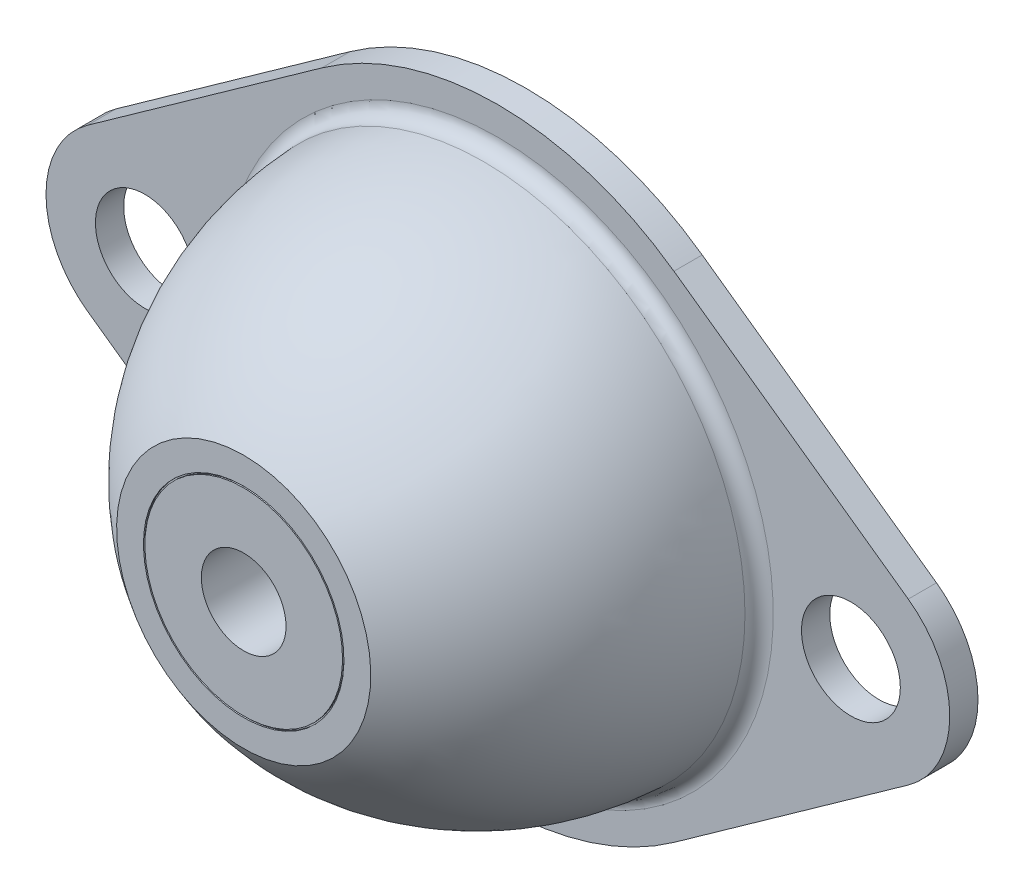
ISO-10303-21;
HEADER;
FILE_DESCRIPTION(('STEP AP214'),'2;1');
FILE_NAME('part.step','',(''),(''),'','','');
FILE_SCHEMA(('AUTOMOTIVE_DESIGN { 1 0 10303 214 1 1 1 1 }'));
ENDSEC;
DATA;
#1=APPLICATION_CONTEXT('core data for automotive mechanical design processes');
#2=APPLICATION_PROTOCOL_DEFINITION('international standard','automotive_design',2000,#1);
#3=PRODUCT_CONTEXT('',#1,'mechanical');
#4=PRODUCT('Part','Part','',(#3));
#5=PRODUCT_RELATED_PRODUCT_CATEGORY('part','',(#4));
#6=PRODUCT_DEFINITION_FORMATION('','',#4);
#7=PRODUCT_DEFINITION_CONTEXT('part definition',#1,'design');
#8=PRODUCT_DEFINITION('design','',#6,#7);
#9=PRODUCT_DEFINITION_SHAPE('','',#8);
#10=(LENGTH_UNIT() NAMED_UNIT(*) SI_UNIT(.MILLI.,.METRE.));
#11=(NAMED_UNIT(*) PLANE_ANGLE_UNIT() SI_UNIT($,.RADIAN.));
#12=(NAMED_UNIT(*) SI_UNIT($,.STERADIAN.) SOLID_ANGLE_UNIT());
#13=UNCERTAINTY_MEASURE_WITH_UNIT(LENGTH_MEASURE(1.E-05),#10,'distance_accuracy_value','');
#14=(GEOMETRIC_REPRESENTATION_CONTEXT(3) GLOBAL_UNCERTAINTY_ASSIGNED_CONTEXT((#13)) GLOBAL_UNIT_ASSIGNED_CONTEXT((#10,
#11,#12)) REPRESENTATION_CONTEXT('',''));
#15=CARTESIAN_POINT('',(0.,0.,0.));
#16=DIRECTION('',(0.,0.,1.));
#17=DIRECTION('',(1.,0.,0.));
#18=AXIS2_PLACEMENT_3D('',#15,#16,#17);
#19=CARTESIAN_POINT('',(0.,0.,2.));
#20=DIRECTION('',(0.,0.,1.));
#21=DIRECTION('',(0.,-1.,0.));
#22=AXIS2_PLACEMENT_3D('',#19,#20,#21);
#23=PLANE('',#22);
#24=DIRECTION('',(-0.814616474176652,-0.58,0.));
#25=VECTOR('',#24,1.);
#26=CARTESIAN_POINT('',(12.53,17.514254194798,2.));
#27=LINE('',#26,#25);
#28=CARTESIAN_POINT('',(12.53,17.514254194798,2.));
#29=VERTEX_POINT('',#28);
#30=CARTESIAN_POINT('',(-4.06,5.70231531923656,2.));
#31=VERTEX_POINT('',#30);
#32=EDGE_CURVE('E141',#29,#31,#27,.T.);
#33=ORIENTED_EDGE('',*,*,#32,.T.);
#34=CARTESIAN_POINT('',(0.,0.,2.));
#35=DIRECTION('',(0.,0.,1.));
#36=DIRECTION('',(1.,0.,0.));
#37=AXIS2_PLACEMENT_3D('',#34,#35,#36);
#38=CIRCLE('',#37,7.);
#39=CARTESIAN_POINT('',(-4.06,-5.70231531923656,2.));
#40=VERTEX_POINT('',#39);
#41=EDGE_CURVE('E74',#31,#40,#38,.T.);
#42=ORIENTED_EDGE('',*,*,#41,.T.);
#43=DIRECTION('',(0.814616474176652,-0.58,0.));
#44=VECTOR('',#43,1.);
#45=CARTESIAN_POINT('',(-4.06,-5.70231531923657,2.));
#46=LINE('',#45,#44);
#47=CARTESIAN_POINT('',(12.53,-17.514254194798,2.));
#48=VERTEX_POINT('',#47);
#49=EDGE_CURVE('E156',#40,#48,#46,.T.);
#50=ORIENTED_EDGE('',*,*,#49,.T.);
#51=CARTESIAN_POINT('',(25.,0.,2.));
#52=DIRECTION('',(0.,0.,1.));
#53=DIRECTION('',(1.,0.,0.));
#54=AXIS2_PLACEMENT_3D('',#51,#52,#53);
#55=CIRCLE('',#54,21.5);
#56=CARTESIAN_POINT('',(37.47,-17.514254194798,2.));
#57=VERTEX_POINT('',#56);
#58=EDGE_CURVE('E169',#48,#57,#55,.T.);
#59=ORIENTED_EDGE('',*,*,#58,.T.);
#60=DIRECTION('',(0.814616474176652,0.58,0.));
#61=VECTOR('',#60,1.);
#62=CARTESIAN_POINT('',(37.47,-17.514254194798,2.));
#63=LINE('',#62,#61);
#64=CARTESIAN_POINT('',(54.06,-5.70231531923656,2.));
#65=VERTEX_POINT('',#64);
#66=EDGE_CURVE('E93',#57,#65,#63,.T.);
#67=ORIENTED_EDGE('',*,*,#66,.T.);
#68=CARTESIAN_POINT('',(50.,0.,2.));
#69=DIRECTION('',(0.,0.,1.));
#70=DIRECTION('',(1.,0.,0.));
#71=AXIS2_PLACEMENT_3D('',#68,#69,#70);
#72=CIRCLE('',#71,7.);
#73=CARTESIAN_POINT('',(54.06,5.70231531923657,2.));
#74=VERTEX_POINT('',#73);
#75=EDGE_CURVE('E87',#65,#74,#72,.T.);
#76=ORIENTED_EDGE('',*,*,#75,.T.);
#77=DIRECTION('',(-0.814616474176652,0.58,0.));
#78=VECTOR('',#77,1.);
#79=CARTESIAN_POINT('',(54.06,5.70231531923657,2.));
#80=LINE('',#79,#78);
#81=CARTESIAN_POINT('',(37.47,17.514254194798,2.));
#82=VERTEX_POINT('',#81);
#83=EDGE_CURVE('E91',#74,#82,#80,.T.);
#84=ORIENTED_EDGE('',*,*,#83,.T.);
#85=CARTESIAN_POINT('',(25.,0.,2.));
#86=DIRECTION('',(0.,0.,1.));
#87=DIRECTION('',(1.,0.,0.));
#88=AXIS2_PLACEMENT_3D('',#85,#86,#87);
#89=CIRCLE('',#88,21.5);
#90=EDGE_CURVE('E31',#82,#29,#89,.T.);
#91=ORIENTED_EDGE('',*,*,#90,.T.);
#92=EDGE_LOOP('',(#33,#42,#50,#59,#67,#76,#84,#91));
#93=FACE_BOUND('',#92,.T.);
#94=CARTESIAN_POINT('',(50.,0.,2.));
#95=DIRECTION('',(0.,0.,1.));
#96=DIRECTION('',(1.,0.,0.));
#97=AXIS2_PLACEMENT_3D('',#94,#95,#96);
#98=CIRCLE('',#97,3.5);
#99=CARTESIAN_POINT('',(53.5,0.,2.));
#100=VERTEX_POINT('',#99);
#101=EDGE_CURVE('E107',#100,#100,#98,.T.);
#102=ORIENTED_EDGE('',*,*,#101,.F.);
#103=EDGE_LOOP('',(#102));
#104=FACE_BOUND('',#103,.T.);
#105=CARTESIAN_POINT('',(0.,0.,2.));
#106=DIRECTION('',(0.,0.,1.));
#107=DIRECTION('',(1.,0.,0.));
#108=AXIS2_PLACEMENT_3D('',#105,#106,#107);
#109=CIRCLE('',#108,3.5);
#110=CARTESIAN_POINT('',(3.5,0.,2.));
#111=VERTEX_POINT('',#110);
#112=EDGE_CURVE('E113',#111,#111,#109,.T.);
#113=ORIENTED_EDGE('',*,*,#112,.F.);
#114=EDGE_LOOP('',(#113));
#115=FACE_BOUND('',#114,.T.);
#116=CARTESIAN_POINT('',(25.,0.,2.));
#117=DIRECTION('',(0.,0.,-1.));
#118=DIRECTION('',(0.,1.,0.));
#119=AXIS2_PLACEMENT_3D('',#116,#117,#118);
#120=CIRCLE('',#119,19.5);
#121=CARTESIAN_POINT('',(25.,19.5,2.));
#122=VERTEX_POINT('',#121);
#123=EDGE_CURVE('E192',#122,#122,#120,.T.);
#124=ORIENTED_EDGE('',*,*,#123,.T.);
#125=EDGE_LOOP('',(#124));
#126=FACE_BOUND('',#125,.T.);
#127=ADVANCED_FACE('F14',(#93,#104,#115,#126),#23,.T.);
#128=CARTESIAN_POINT('',(12.53,17.514254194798,2.));
#129=DIRECTION('',(0.58,-0.814616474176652,0.));
#130=DIRECTION('',(0.814616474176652,0.58,0.));
#131=AXIS2_PLACEMENT_3D('',#128,#129,#130);
#132=PLANE('',#131);
#133=DIRECTION('',(-0.814616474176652,-0.58,0.));
#134=VECTOR('',#133,1.);
#135=CARTESIAN_POINT('',(12.53,17.514254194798,0.));
#136=LINE('',#135,#134);
#137=CARTESIAN_POINT('',(12.53,17.514254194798,0.));
#138=VERTEX_POINT('',#137);
#139=CARTESIAN_POINT('',(-4.06,5.70231531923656,0.));
#140=VERTEX_POINT('',#139);
#141=EDGE_CURVE('E117',#138,#140,#136,.T.);
#142=ORIENTED_EDGE('',*,*,#141,.T.);
#143=DIRECTION('',(0.,0.,-1.));
#144=VECTOR('',#143,1.);
#145=CARTESIAN_POINT('',(-4.06,5.70231531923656,2.));
#146=LINE('',#145,#144);
#147=EDGE_CURVE('E9',#31,#140,#146,.T.);
#148=ORIENTED_EDGE('',*,*,#147,.F.);
#149=ORIENTED_EDGE('',*,*,#32,.F.);
#150=DIRECTION('',(0.,0.,-1.));
#151=VECTOR('',#150,1.);
#152=CARTESIAN_POINT('',(12.53,17.514254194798,2.));
#153=LINE('',#152,#151);
#154=EDGE_CURVE('E116',#29,#138,#153,.T.);
#155=ORIENTED_EDGE('',*,*,#154,.T.);
#156=EDGE_LOOP('',(#142,#148,#149,#155));
#157=FACE_BOUND('',#156,.T.);
#158=ADVANCED_FACE('F16',(#157),#132,.F.);
#159=CARTESIAN_POINT('',(0.,0.,2.));
#160=DIRECTION('',(0.,0.,-1.));
#161=DIRECTION('',(0.,1.,0.));
#162=AXIS2_PLACEMENT_3D('',#159,#160,#161);
#163=CYLINDRICAL_SURFACE('',#162,7.);
#164=CARTESIAN_POINT('',(0.,0.,0.));
#165=DIRECTION('',(0.,0.,1.));
#166=DIRECTION('',(1.,0.,0.));
#167=AXIS2_PLACEMENT_3D('',#164,#165,#166);
#168=CIRCLE('',#167,7.);
#169=CARTESIAN_POINT('',(-4.06,-5.70231531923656,0.));
#170=VERTEX_POINT('',#169);
#171=EDGE_CURVE('E120',#140,#170,#168,.T.);
#172=ORIENTED_EDGE('',*,*,#171,.T.);
#173=DIRECTION('',(0.,0.,-1.));
#174=VECTOR('',#173,1.);
#175=CARTESIAN_POINT('',(-4.06,-5.70231531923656,2.));
#176=LINE('',#175,#174);
#177=EDGE_CURVE('E23',#40,#170,#176,.T.);
#178=ORIENTED_EDGE('',*,*,#177,.F.);
#179=ORIENTED_EDGE('',*,*,#41,.F.);
#180=ORIENTED_EDGE('',*,*,#147,.T.);
#181=EDGE_LOOP('',(#172,#178,#179,#180));
#182=FACE_BOUND('',#181,.T.);
#183=ADVANCED_FACE('F236',(#182),#163,.T.);
#184=CARTESIAN_POINT('',(-4.06,-5.70231531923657,2.));
#185=DIRECTION('',(0.58,0.814616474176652,0.));
#186=DIRECTION('',(-0.814616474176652,0.58,0.));
#187=AXIS2_PLACEMENT_3D('',#184,#185,#186);
#188=PLANE('',#187);
#189=DIRECTION('',(0.814616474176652,-0.58,0.));
#190=VECTOR('',#189,1.);
#191=CARTESIAN_POINT('',(-4.06,-5.70231531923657,0.));
#192=LINE('',#191,#190);
#193=CARTESIAN_POINT('',(12.53,-17.514254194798,0.));
#194=VERTEX_POINT('',#193);
#195=EDGE_CURVE('E123',#170,#194,#192,.T.);
#196=ORIENTED_EDGE('',*,*,#195,.T.);
#197=DIRECTION('',(0.,0.,-1.));
#198=VECTOR('',#197,1.);
#199=CARTESIAN_POINT('',(12.53,-17.514254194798,2.));
#200=LINE('',#199,#198);
#201=EDGE_CURVE('E148',#48,#194,#200,.T.);
#202=ORIENTED_EDGE('',*,*,#201,.F.);
#203=ORIENTED_EDGE('',*,*,#49,.F.);
#204=ORIENTED_EDGE('',*,*,#177,.T.);
#205=EDGE_LOOP('',(#196,#202,#203,#204));
#206=FACE_BOUND('',#205,.T.);
#207=ADVANCED_FACE('F154',(#206),#188,.F.);
#208=CARTESIAN_POINT('',(25.,0.,2.));
#209=DIRECTION('',(0.,0.,-1.));
#210=DIRECTION('',(0.,1.,0.));
#211=AXIS2_PLACEMENT_3D('',#208,#209,#210);
#212=CYLINDRICAL_SURFACE('',#211,21.5);
#213=CARTESIAN_POINT('',(25.,0.,0.));
#214=DIRECTION('',(0.,0.,1.));
#215=DIRECTION('',(1.,0.,0.));
#216=AXIS2_PLACEMENT_3D('',#213,#214,#215);
#217=CIRCLE('',#216,21.5);
#218=CARTESIAN_POINT('',(37.47,-17.514254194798,0.));
#219=VERTEX_POINT('',#218);
#220=EDGE_CURVE('E125',#194,#219,#217,.T.);
#221=ORIENTED_EDGE('',*,*,#220,.T.);
#222=DIRECTION('',(0.,0.,-1.));
#223=VECTOR('',#222,1.);
#224=CARTESIAN_POINT('',(37.47,-17.514254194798,2.));
#225=LINE('',#224,#223);
#226=EDGE_CURVE('E145',#57,#219,#225,.T.);
#227=ORIENTED_EDGE('',*,*,#226,.F.);
#228=ORIENTED_EDGE('',*,*,#58,.F.);
#229=ORIENTED_EDGE('',*,*,#201,.T.);
#230=EDGE_LOOP('',(#221,#227,#228,#229));
#231=FACE_BOUND('',#230,.T.);
#232=ADVANCED_FACE('F165',(#231),#212,.T.);
#233=CARTESIAN_POINT('',(37.47,-17.514254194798,2.));
#234=DIRECTION('',(-0.58,0.814616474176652,0.));
#235=DIRECTION('',(-0.814616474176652,-0.58,0.));
#236=AXIS2_PLACEMENT_3D('',#233,#234,#235);
#237=PLANE('',#236);
#238=DIRECTION('',(0.814616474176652,0.58,0.));
#239=VECTOR('',#238,1.);
#240=CARTESIAN_POINT('',(37.47,-17.514254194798,0.));
#241=LINE('',#240,#239);
#242=CARTESIAN_POINT('',(54.06,-5.70231531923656,0.));
#243=VERTEX_POINT('',#242);
#244=EDGE_CURVE('E127',#219,#243,#241,.T.);
#245=ORIENTED_EDGE('',*,*,#244,.T.);
#246=DIRECTION('',(0.,0.,-1.));
#247=VECTOR('',#246,1.);
#248=CARTESIAN_POINT('',(54.06,-5.70231531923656,2.));
#249=LINE('',#248,#247);
#250=EDGE_CURVE('E102',#65,#243,#249,.T.);
#251=ORIENTED_EDGE('',*,*,#250,.F.);
#252=ORIENTED_EDGE('',*,*,#66,.F.);
#253=ORIENTED_EDGE('',*,*,#226,.T.);
#254=EDGE_LOOP('',(#245,#251,#252,#253));
#255=FACE_BOUND('',#254,.T.);
#256=ADVANCED_FACE('F168',(#255),#237,.F.);
#257=CARTESIAN_POINT('',(50.,0.,2.));
#258=DIRECTION('',(0.,0.,-1.));
#259=DIRECTION('',(0.,1.,0.));
#260=AXIS2_PLACEMENT_3D('',#257,#258,#259);
#261=CYLINDRICAL_SURFACE('',#260,7.);
#262=CARTESIAN_POINT('',(50.,0.,0.));
#263=DIRECTION('',(0.,0.,1.));
#264=DIRECTION('',(1.,0.,0.));
#265=AXIS2_PLACEMENT_3D('',#262,#263,#264);
#266=CIRCLE('',#265,7.);
#267=CARTESIAN_POINT('',(54.06,5.70231531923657,0.));
#268=VERTEX_POINT('',#267);
#269=EDGE_CURVE('E101',#243,#268,#266,.T.);
#270=ORIENTED_EDGE('',*,*,#269,.T.);
#271=DIRECTION('',(0.,0.,-1.));
#272=VECTOR('',#271,1.);
#273=CARTESIAN_POINT('',(54.06,5.70231531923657,2.));
#274=LINE('',#273,#272);
#275=EDGE_CURVE('E98',#74,#268,#274,.T.);
#276=ORIENTED_EDGE('',*,*,#275,.F.);
#277=ORIENTED_EDGE('',*,*,#75,.F.);
#278=ORIENTED_EDGE('',*,*,#250,.T.);
#279=EDGE_LOOP('',(#270,#276,#277,#278));
#280=FACE_BOUND('',#279,.T.);
#281=ADVANCED_FACE('F99',(#280),#261,.T.);
#282=CARTESIAN_POINT('',(54.06,5.70231531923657,2.));
#283=DIRECTION('',(-0.58,-0.814616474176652,0.));
#284=DIRECTION('',(0.814616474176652,-0.58,0.));
#285=AXIS2_PLACEMENT_3D('',#282,#283,#284);
#286=PLANE('',#285);
#287=DIRECTION('',(-0.814616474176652,0.58,0.));
#288=VECTOR('',#287,1.);
#289=CARTESIAN_POINT('',(54.06,5.70231531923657,0.));
#290=LINE('',#289,#288);
#291=CARTESIAN_POINT('',(37.47,17.514254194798,0.));
#292=VERTEX_POINT('',#291);
#293=EDGE_CURVE('E60',#268,#292,#290,.T.);
#294=ORIENTED_EDGE('',*,*,#293,.T.);
#295=DIRECTION('',(0.,0.,-1.));
#296=VECTOR('',#295,1.);
#297=CARTESIAN_POINT('',(37.47,17.514254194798,2.));
#298=LINE('',#297,#296);
#299=EDGE_CURVE('E103',#82,#292,#298,.T.);
#300=ORIENTED_EDGE('',*,*,#299,.F.);
#301=ORIENTED_EDGE('',*,*,#83,.F.);
#302=ORIENTED_EDGE('',*,*,#275,.T.);
#303=EDGE_LOOP('',(#294,#300,#301,#302));
#304=FACE_BOUND('',#303,.T.);
#305=ADVANCED_FACE('F105',(#304),#286,.F.);
#306=CARTESIAN_POINT('',(50.,0.,2.));
#307=DIRECTION('',(0.,0.,-1.));
#308=DIRECTION('',(0.,1.,0.));
#309=AXIS2_PLACEMENT_3D('',#306,#307,#308);
#310=CYLINDRICAL_SURFACE('',#309,3.5);
#311=ORIENTED_EDGE('',*,*,#101,.T.);
#312=EDGE_LOOP('',(#311));
#313=FACE_BOUND('',#312,.T.);
#314=CARTESIAN_POINT('',(50.,0.,0.));
#315=DIRECTION('',(0.,0.,1.));
#316=DIRECTION('',(1.,0.,0.));
#317=AXIS2_PLACEMENT_3D('',#314,#315,#316);
#318=CIRCLE('',#317,3.5);
#319=CARTESIAN_POINT('',(53.5,0.,0.));
#320=VERTEX_POINT('',#319);
#321=EDGE_CURVE('E132',#320,#320,#318,.T.);
#322=ORIENTED_EDGE('',*,*,#321,.F.);
#323=EDGE_LOOP('',(#322));
#324=FACE_BOUND('',#323,.T.);
#325=ADVANCED_FACE('F251',(#313,#324),#310,.F.);
#326=CARTESIAN_POINT('',(25.,0.,2.));
#327=DIRECTION('',(0.,0.,-1.));
#328=DIRECTION('',(0.,1.,0.));
#329=AXIS2_PLACEMENT_3D('',#326,#327,#328);
#330=CYLINDRICAL_SURFACE('',#329,9.);
#331=CARTESIAN_POINT('',(25.,0.,10.));
#332=DIRECTION('',(0.,0.,-1.));
#333=DIRECTION('',(0.,1.,0.));
#334=AXIS2_PLACEMENT_3D('',#331,#332,#333);
#335=CIRCLE('',#334,9.);
#336=CARTESIAN_POINT('',(25.,9.,10.));
#337=VERTEX_POINT('',#336);
#338=EDGE_CURVE('E195',#337,#337,#335,.T.);
#339=ORIENTED_EDGE('',*,*,#338,.F.);
#340=EDGE_LOOP('',(#339));
#341=FACE_BOUND('',#340,.T.);
#342=CARTESIAN_POINT('',(25.,0.,0.));
#343=DIRECTION('',(0.,0.,1.));
#344=DIRECTION('',(1.,0.,0.));
#345=AXIS2_PLACEMENT_3D('',#342,#343,#344);
#346=CIRCLE('',#345,9.);
#347=CARTESIAN_POINT('',(34.,0.,0.));
#348=VERTEX_POINT('',#347);
#349=EDGE_CURVE('E135',#348,#348,#346,.T.);
#350=ORIENTED_EDGE('',*,*,#349,.F.);
#351=EDGE_LOOP('',(#350));
#352=FACE_BOUND('',#351,.T.);
#353=ADVANCED_FACE('F247',(#341,#352),#330,.F.);
#354=CARTESIAN_POINT('',(0.,0.,2.));
#355=DIRECTION('',(0.,0.,-1.));
#356=DIRECTION('',(0.,1.,0.));
#357=AXIS2_PLACEMENT_3D('',#354,#355,#356);
#358=CYLINDRICAL_SURFACE('',#357,3.5);
#359=ORIENTED_EDGE('',*,*,#112,.T.);
#360=EDGE_LOOP('',(#359));
#361=FACE_BOUND('',#360,.T.);
#362=CARTESIAN_POINT('',(0.,0.,0.));
#363=DIRECTION('',(0.,0.,1.));
#364=DIRECTION('',(1.,0.,0.));
#365=AXIS2_PLACEMENT_3D('',#362,#363,#364);
#366=CIRCLE('',#365,3.5);
#367=CARTESIAN_POINT('',(3.5,0.,0.));
#368=VERTEX_POINT('',#367);
#369=EDGE_CURVE('E138',#368,#368,#366,.T.);
#370=ORIENTED_EDGE('',*,*,#369,.F.);
#371=EDGE_LOOP('',(#370));
#372=FACE_BOUND('',#371,.T.);
#373=ADVANCED_FACE('F244',(#361,#372),#358,.F.);
#374=CARTESIAN_POINT('',(25.,0.,2.));
#375=DIRECTION('',(0.,0.,-1.));
#376=DIRECTION('',(0.,1.,0.));
#377=AXIS2_PLACEMENT_3D('',#374,#375,#376);
#378=CYLINDRICAL_SURFACE('',#377,21.5);
#379=CARTESIAN_POINT('',(25.,0.,0.));
#380=DIRECTION('',(0.,0.,1.));
#381=DIRECTION('',(1.,0.,0.));
#382=AXIS2_PLACEMENT_3D('',#379,#380,#381);
#383=CIRCLE('',#382,21.5);
#384=EDGE_CURVE('E66',#292,#138,#383,.T.);
#385=ORIENTED_EDGE('',*,*,#384,.T.);
#386=ORIENTED_EDGE('',*,*,#154,.F.);
#387=ORIENTED_EDGE('',*,*,#90,.F.);
#388=ORIENTED_EDGE('',*,*,#299,.T.);
#389=EDGE_LOOP('',(#385,#386,#387,#388));
#390=FACE_BOUND('',#389,.T.);
#391=ADVANCED_FACE('F242',(#390),#378,.T.);
#392=CARTESIAN_POINT('',(0.,0.,0.));
#393=DIRECTION('',(0.,0.,1.));
#394=DIRECTION('',(0.,-1.,0.));
#395=AXIS2_PLACEMENT_3D('',#392,#393,#394);
#396=PLANE('',#395);
#397=ORIENTED_EDGE('',*,*,#349,.T.);
#398=EDGE_LOOP('',(#397));
#399=FACE_BOUND('',#398,.T.);
#400=ORIENTED_EDGE('',*,*,#141,.F.);
#401=ORIENTED_EDGE('',*,*,#384,.F.);
#402=ORIENTED_EDGE('',*,*,#293,.F.);
#403=ORIENTED_EDGE('',*,*,#269,.F.);
#404=ORIENTED_EDGE('',*,*,#244,.F.);
#405=ORIENTED_EDGE('',*,*,#220,.F.);
#406=ORIENTED_EDGE('',*,*,#195,.F.);
#407=ORIENTED_EDGE('',*,*,#171,.F.);
#408=EDGE_LOOP('',(#400,#401,#402,#403,#404,#405,#406,#407));
#409=FACE_BOUND('',#408,.T.);
#410=ORIENTED_EDGE('',*,*,#321,.T.);
#411=EDGE_LOOP('',(#410));
#412=FACE_BOUND('',#411,.T.);
#413=ORIENTED_EDGE('',*,*,#369,.T.);
#414=EDGE_LOOP('',(#413));
#415=FACE_BOUND('',#414,.T.);
#416=ADVANCED_FACE('F160',(#399,#409,#412,#415),#396,.F.);
#417=CARTESIAN_POINT('',(31.,0.,13.));
#418=DIRECTION('',(0.,0.,1.));
#419=DIRECTION('',(0.,-1.,0.));
#420=AXIS2_PLACEMENT_3D('',#417,#418,#419);
#421=PLANE('',#420);
#422=CARTESIAN_POINT('',(25.,0.,13.));
#423=DIRECTION('',(0.,0.,-1.));
#424=DIRECTION('',(0.,1.,0.));
#425=AXIS2_PLACEMENT_3D('',#422,#423,#424);
#426=CIRCLE('',#425,3.);
#427=CARTESIAN_POINT('',(25.,3.,13.));
#428=VERTEX_POINT('',#427);
#429=EDGE_CURVE('E204',#428,#428,#426,.T.);
#430=ORIENTED_EDGE('',*,*,#429,.F.);
#431=EDGE_LOOP('',(#430));
#432=FACE_BOUND('',#431,.T.);
#433=CARTESIAN_POINT('',(25.,0.,13.));
#434=DIRECTION('',(0.,0.,-1.));
#435=DIRECTION('',(0.,1.,0.));
#436=AXIS2_PLACEMENT_3D('',#433,#434,#435);
#437=CIRCLE('',#436,6.);
#438=CARTESIAN_POINT('',(25.,6.,13.));
#439=VERTEX_POINT('',#438);
#440=EDGE_CURVE('E201',#439,#439,#437,.T.);
#441=ORIENTED_EDGE('',*,*,#440,.T.);
#442=EDGE_LOOP('',(#441));
#443=FACE_BOUND('',#442,.T.);
#444=ADVANCED_FACE('F241',(#432,#443),#421,.F.);
#445=CARTESIAN_POINT('',(25.,0.,13.));
#446=DIRECTION('',(0.,0.,-1.));
#447=DIRECTION('',(0.,1.,0.));
#448=AXIS2_PLACEMENT_3D('',#445,#446,#447);
#449=TOROIDAL_SURFACE('',#448,7.,1.);
#450=CARTESIAN_POINT('',(25.,0.,12.));
#451=DIRECTION('',(0.,0.,-1.));
#452=DIRECTION('',(0.,1.,0.));
#453=AXIS2_PLACEMENT_3D('',#450,#451,#452);
#454=CIRCLE('',#453,7.);
#455=CARTESIAN_POINT('',(25.,7.,12.));
#456=VERTEX_POINT('',#455);
#457=EDGE_CURVE('E198',#456,#456,#454,.T.);
#458=ORIENTED_EDGE('',*,*,#457,.T.);
#459=EDGE_LOOP('',(#458));
#460=FACE_BOUND('',#459,.T.);
#461=ORIENTED_EDGE('',*,*,#440,.F.);
#462=EDGE_LOOP('',(#461));
#463=FACE_BOUND('',#462,.T.);
#464=ADVANCED_FACE('F227',(#460,#463),#449,.T.);
#465=CARTESIAN_POINT('',(25.,0.,10.));
#466=DIRECTION('',(0.,0.,-1.));
#467=DIRECTION('',(0.,1.,0.));
#468=AXIS2_PLACEMENT_3D('',#465,#466,#467);
#469=TOROIDAL_SURFACE('',#468,7.,2.);
#470=ORIENTED_EDGE('',*,*,#457,.F.);
#471=EDGE_LOOP('',(#470));
#472=FACE_BOUND('',#471,.T.);
#473=ORIENTED_EDGE('',*,*,#338,.T.);
#474=EDGE_LOOP('',(#473));
#475=FACE_BOUND('',#474,.T.);
#476=ADVANCED_FACE('F216',(#472,#475),#469,.F.);
#477=CARTESIAN_POINT('',(25.,0.,20.));
#478=DIRECTION('',(0.,0.,-1.));
#479=DIRECTION('',(0.,1.,0.));
#480=AXIS2_PLACEMENT_3D('',#477,#478,#479);
#481=PLANE('',#480);
#482=CARTESIAN_POINT('',(25.,0.,20.));
#483=DIRECTION('',(0.,0.,-1.));
#484=DIRECTION('',(0.,1.,0.));
#485=AXIS2_PLACEMENT_3D('',#482,#483,#484);
#486=CIRCLE('',#485,7.);
#487=CARTESIAN_POINT('',(25.,7.,20.));
#488=VERTEX_POINT('',#487);
#489=EDGE_CURVE('E121',#488,#488,#486,.T.);
#490=ORIENTED_EDGE('',*,*,#489,.F.);
#491=EDGE_LOOP('',(#490));
#492=FACE_BOUND('',#491,.T.);
#493=CARTESIAN_POINT('',(25.,0.,20.));
#494=DIRECTION('',(0.,0.,1.));
#495=DIRECTION('',(0.,-1.,0.));
#496=AXIS2_PLACEMENT_3D('',#493,#494,#495);
#497=CIRCLE('',#496,3.);
#498=CARTESIAN_POINT('',(25.,-3.,20.));
#499=VERTEX_POINT('',#498);
#500=EDGE_CURVE('E207',#499,#499,#497,.T.);
#501=ORIENTED_EDGE('',*,*,#500,.F.);
#502=EDGE_LOOP('',(#501));
#503=FACE_BOUND('',#502,.T.);
#504=ADVANCED_FACE('F213',(#492,#503),#481,.F.);
#505=CARTESIAN_POINT('',(25.,0.,13.));
#506=DIRECTION('',(0.,0.,-1.));
#507=DIRECTION('',(0.,1.,0.));
#508=AXIS2_PLACEMENT_3D('',#505,#506,#507);
#509=CYLINDRICAL_SURFACE('',#508,7.);
#510=CARTESIAN_POINT('',(25.,0.,19.9));
#511=DIRECTION('',(0.,0.,-1.));
#512=DIRECTION('',(0.,1.,0.));
#513=AXIS2_PLACEMENT_3D('',#510,#511,#512);
#514=CIRCLE('',#513,7.);
#515=CARTESIAN_POINT('',(25.,7.,19.9));
#516=VERTEX_POINT('',#515);
#517=EDGE_CURVE('E177',#516,#516,#514,.T.);
#518=ORIENTED_EDGE('',*,*,#517,.F.);
#519=EDGE_LOOP('',(#518));
#520=FACE_BOUND('',#519,.T.);
#521=ORIENTED_EDGE('',*,*,#489,.T.);
#522=EDGE_LOOP('',(#521));
#523=FACE_BOUND('',#522,.T.);
#524=ADVANCED_FACE('F215',(#520,#523),#509,.T.);
#525=CARTESIAN_POINT('',(32.,0.,19.9));
#526=DIRECTION('',(0.,0.,-1.));
#527=DIRECTION('',(0.,1.,0.));
#528=AXIS2_PLACEMENT_3D('',#525,#526,#527);
#529=PLANE('',#528);
#530=CARTESIAN_POINT('',(25.,0.,19.9));
#531=DIRECTION('',(0.,0.,-1.));
#532=DIRECTION('',(0.,1.,0.));
#533=AXIS2_PLACEMENT_3D('',#530,#531,#532);
#534=CIRCLE('',#533,7.1);
#535=CARTESIAN_POINT('',(25.,7.1,19.9));
#536=VERTEX_POINT('',#535);
#537=EDGE_CURVE('E180',#536,#536,#534,.T.);
#538=ORIENTED_EDGE('',*,*,#537,.F.);
#539=EDGE_LOOP('',(#538));
#540=FACE_BOUND('',#539,.T.);
#541=ORIENTED_EDGE('',*,*,#517,.T.);
#542=EDGE_LOOP('',(#541));
#543=FACE_BOUND('',#542,.T.);
#544=ADVANCED_FACE('F224',(#540,#543),#529,.F.);
#545=CARTESIAN_POINT('',(25.,0.,13.));
#546=DIRECTION('',(0.,0.,-1.));
#547=DIRECTION('',(0.,1.,0.));
#548=AXIS2_PLACEMENT_3D('',#545,#546,#547);
#549=CYLINDRICAL_SURFACE('',#548,7.1);
#550=CARTESIAN_POINT('',(25.,0.,20.));
#551=DIRECTION('',(0.,0.,-1.));
#552=DIRECTION('',(0.,1.,0.));
#553=AXIS2_PLACEMENT_3D('',#550,#551,#552);
#554=CIRCLE('',#553,7.1);
#555=CARTESIAN_POINT('',(25.,7.1,20.));
#556=VERTEX_POINT('',#555);
#557=EDGE_CURVE('E183',#556,#556,#554,.T.);
#558=ORIENTED_EDGE('',*,*,#557,.F.);
#559=EDGE_LOOP('',(#558));
#560=FACE_BOUND('',#559,.T.);
#561=ORIENTED_EDGE('',*,*,#537,.T.);
#562=EDGE_LOOP('',(#561));
#563=FACE_BOUND('',#562,.T.);
#564=ADVANCED_FACE('F356',(#560,#563),#549,.F.);
#565=CARTESIAN_POINT('',(32.1,0.,20.));
#566=DIRECTION('',(0.,0.,-1.));
#567=DIRECTION('',(0.,1.,0.));
#568=AXIS2_PLACEMENT_3D('',#565,#566,#567);
#569=PLANE('',#568);
#570=CARTESIAN_POINT('',(25.,0.,20.));
#571=DIRECTION('',(0.,0.,-1.));
#572=DIRECTION('',(0.,1.,0.));
#573=AXIS2_PLACEMENT_3D('',#570,#571,#572);
#574=CIRCLE('',#573,9.);
#575=CARTESIAN_POINT('',(25.,9.,20.));
#576=VERTEX_POINT('',#575);
#577=EDGE_CURVE('E186',#576,#576,#574,.T.);
#578=ORIENTED_EDGE('',*,*,#577,.F.);
#579=EDGE_LOOP('',(#578));
#580=FACE_BOUND('',#579,.T.);
#581=ORIENTED_EDGE('',*,*,#557,.T.);
#582=EDGE_LOOP('',(#581));
#583=FACE_BOUND('',#582,.T.);
#584=ADVANCED_FACE('F366',(#580,#583),#569,.F.);
#585=CARTESIAN_POINT('',(25.,0.,2.14911858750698));
#586=DIRECTION('',(0.,0.,-1.));
#587=DIRECTION('',(0.,1.,0.));
#588=AXIS2_PLACEMENT_3D('',#585,#586,#587);
#589=DEGENERATE_TOROIDAL_SURFACE('',#588,2.98315621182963,21.5,.F.);
#590=ORIENTED_EDGE('',*,*,#577,.T.);
#591=EDGE_LOOP('',(#590));
#592=FACE_BOUND('',#591,.T.);
#593=CARTESIAN_POINT('',(25.,0.,3.00000000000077));
#594=DIRECTION('',(0.,0.,-1.));
#595=DIRECTION('',(0.,1.,0.));
#596=AXIS2_PLACEMENT_3D('',#593,#594,#595);
#597=CIRCLE('',#596,18.5);
#598=CARTESIAN_POINT('',(25.,18.5,3.00000000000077));
#599=VERTEX_POINT('',#598);
#600=EDGE_CURVE('E189',#599,#599,#597,.T.);
#601=ORIENTED_EDGE('',*,*,#600,.F.);
#602=EDGE_LOOP('',(#601));
#603=FACE_BOUND('',#602,.T.);
#604=ADVANCED_FACE('F377',(#592,#603),#589,.F.);
#605=CARTESIAN_POINT('',(25.,0.,3.));
#606=DIRECTION('',(0.,0.,-1.));
#607=DIRECTION('',(0.,1.,0.));
#608=AXIS2_PLACEMENT_3D('',#605,#606,#607);
#609=TOROIDAL_SURFACE('',#608,19.5,1.);
#610=ORIENTED_EDGE('',*,*,#123,.F.);
#611=EDGE_LOOP('',(#610));
#612=FACE_BOUND('',#611,.T.);
#613=ORIENTED_EDGE('',*,*,#600,.T.);
#614=EDGE_LOOP('',(#613));
#615=FACE_BOUND('',#614,.T.);
#616=ADVANCED_FACE('F388',(#612,#615),#609,.F.);
#617=CARTESIAN_POINT('',(25.,0.,0.));
#618=DIRECTION('',(0.,0.,1.));
#619=DIRECTION('',(0.,-1.,0.));
#620=AXIS2_PLACEMENT_3D('',#617,#618,#619);
#621=CYLINDRICAL_SURFACE('',#620,3.);
#622=ORIENTED_EDGE('',*,*,#429,.T.);
#623=EDGE_LOOP('',(#622));
#624=FACE_BOUND('',#623,.T.);
#625=ORIENTED_EDGE('',*,*,#500,.T.);
#626=EDGE_LOOP('',(#625));
#627=FACE_BOUND('',#626,.T.);
#628=ADVANCED_FACE('F211',(#624,#627),#621,.F.);
#629=CLOSED_SHELL('',(#127,#158,#183,#207,#232,#256,#281,#305,#325,#353,#373,#391,#416,#444,
#464,#476,#504,#524,#544,#564,#584,#604,#616,#628));
#630=MANIFOLD_SOLID_BREP('B1',#629);
#631=ADVANCED_BREP_SHAPE_REPRESENTATION('',(#18,#630),#14);
#632=SHAPE_DEFINITION_REPRESENTATION(#9,#631);
ENDSEC;
END-ISO-10303-21;
